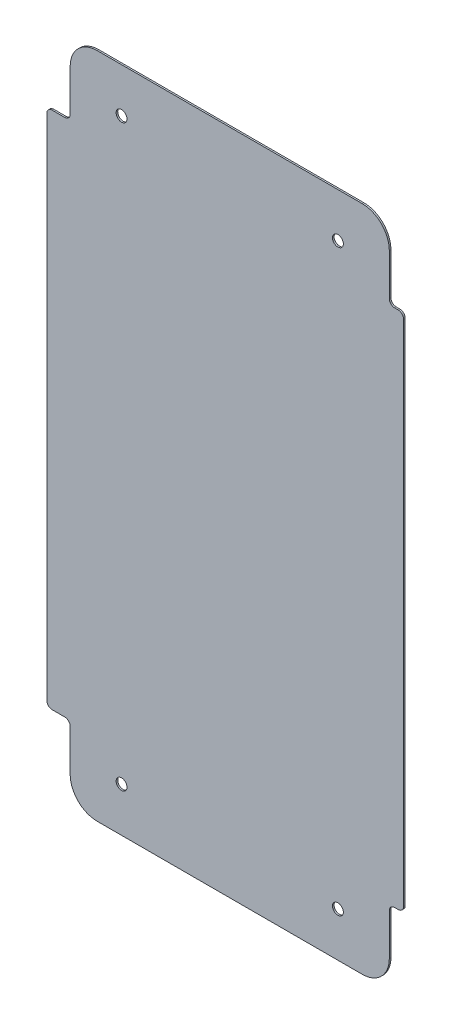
from build123d import *

# Parameters (mm, degrees)
BOSS_EXTRUDE1_DEPTH    = 0.762
F_10_CLEARANCE_HOLE1_D = 5.1054
FILLET1_R              = 2.54


with BuildPart() as part:
    # Sketch1 → Boss-Extrude1 (new body)
    with BuildSketch(Plane.XY):
        with BuildLine():
            Line((74.93, 144.018), (74.93, 121.92))
            Line((74.93, 121.92), (81.661, 121.92))
            Line((81.661, 121.92), (81.661, -121.92))
            Line((81.661, -121.92), (74.93, -121.92))
            Line((74.93, -121.92), (74.93, -144.018))
            ThreePointArc((74.93, -144.018), (71.210256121, -152.998256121), (62.23, -156.718))
            Line((62.23, -156.718), (-62.23, -156.718))
            ThreePointArc((-62.23, -156.718), (-71.210256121, -152.998256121), (-74.93, -144.018))
            Line((-74.93, -144.018), (-74.93, -121.92))
            Line((-74.93, -121.92), (-85.9282, -121.92))
            Line((-85.9282, -121.92), (-85.9282, 121.92))
            Line((-85.9282, 121.92), (-74.93, 121.92))
            Line((-74.93, 121.92), (-74.93, 144.018))
            ThreePointArc((-74.93, 144.018), (-71.210256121, 152.998256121), (-62.23, 156.718))
            Line((-62.23, 156.718), (62.23, 156.718))
            ThreePointArc((62.23, 156.718), (71.210256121, 152.998256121), (74.93, 144.018))
        make_face()
    extrude(amount=BOSS_EXTRUDE1_DEPTH)

    # 10 Clearance Hole1 (through all)
    with Locations(Plane(origin=(0, 0, 0), x_dir=(-1, 0, 0), z_dir=(0, 0, -1))):
        with Locations((-50.8, 135.89), (50.8, 135.89), (50.8, -135.89), (-50.8, -135.89)):
            Hole(F_10_CLEARANCE_HOLE1_D / 2)

    # Fillet1
    fillet1_edges = [part.edges().sort_by_distance(p)[0] for p in [
        (81.661, -121.92, 0.381),
        (74.93, -121.92, 0.381),
        (-74.93, -121.92, 0.381),
        (-85.9282, -121.92, 0.381),
        (-85.9282, 121.92, 0.381),
        (-74.93, 121.92, 0.381),
        (74.93, 121.92, 0.381),
        (81.661, 121.92, 0.381),
    ]]
    fillet(fillet1_edges, radius=FILLET1_R)


solid = part.part
